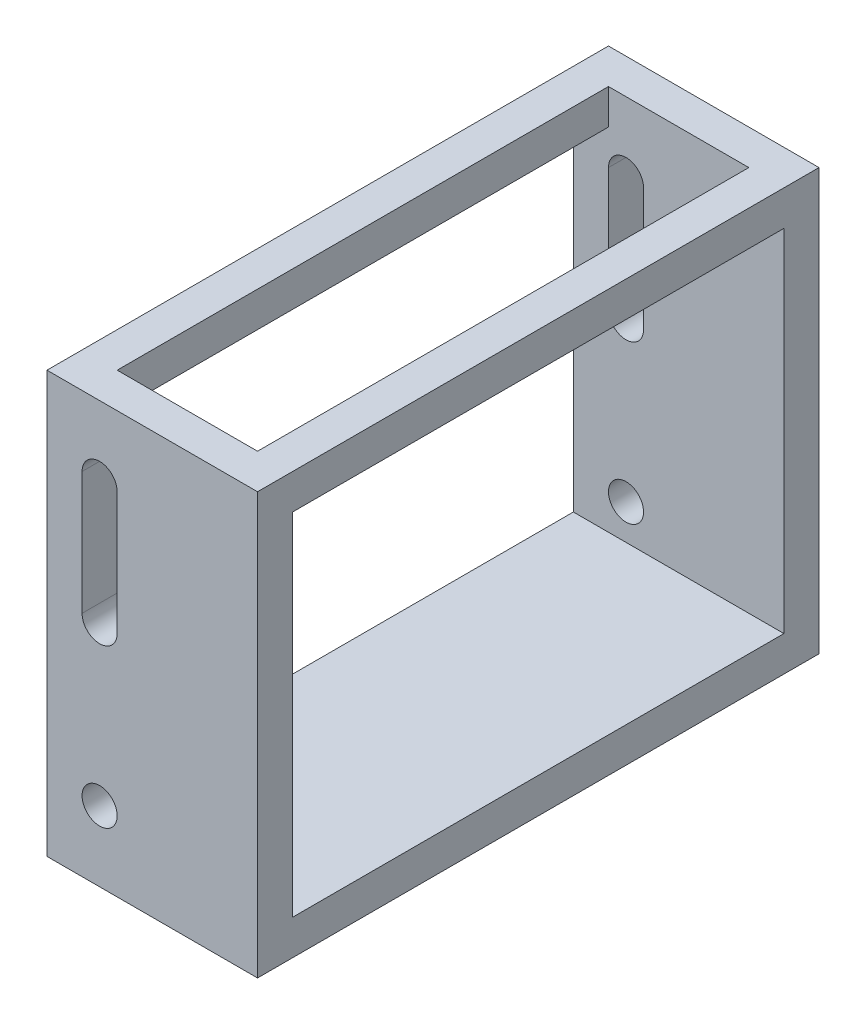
from build123d import *

# Parameters (mm, degrees)
SKETCH1_W           = 76.2
SKETCH1_H           = 203.2
BOSS_EXTRUDE1_DEPTH = 12.7
SKETCH2_W           = 76.2
SKETCH2_H           = 12.7
BOSS_EXTRUDE2_DEPTH = 127
SKETCH3_W           = 76.2
SKETCH3_H           = 203.2
SKETCH3_W_2         = 50.8
SKETCH3_H_2         = 177.8
BOSS_EXTRUDE3_DEPTH = 12.7
SKETCH4_R           = 6.35
CUT_EXTRUDE1_DEPTH  = 266.183785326


with BuildPart() as part:
    # Sketch1 → Boss-Extrude1 (new body)
    with BuildSketch(Plane(origin=(0, 0, 0), x_dir=(1, 0, 0), z_dir=(0, 1, 0))):
        with Locations((38.1, 101.6)):
            Rectangle(SKETCH1_W, SKETCH1_H)
    extrude(amount=BOSS_EXTRUDE1_DEPTH)

    # Sketch2 → Boss-Extrude2 (add)
    with BuildSketch(Plane(origin=(0, 12.7, 0), x_dir=(1, 0, 0), z_dir=(0, 1, 0))):
        with Locations((38.1, 196.85)):
            Rectangle(SKETCH2_W, SKETCH2_H)
        with Locations((38.1, 6.35)):
            Rectangle(SKETCH2_W, SKETCH2_H)
    extrude(amount=BOSS_EXTRUDE2_DEPTH)

    # Sketch3 → Boss-Extrude3 (add)
    with BuildSketch(Plane(origin=(0, 139.7, 0), x_dir=(1, 0, 0), z_dir=(0, 1, 0))):
        with Locations((38.1, 101.6)):
            Rectangle(SKETCH3_W, SKETCH3_H)
        with Locations((38.1, 101.6)):
            Rectangle(SKETCH3_W_2, SKETCH3_H_2, mode=Mode.SUBTRACT)
    extrude(amount=BOSS_EXTRUDE3_DEPTH)

    # Sketch4 → Cut-Extrude1 (cut, through all)
    with BuildSketch(Plane.XY):
        with Locations((19.05, 25.4)):
            Circle(SKETCH4_R)
        with BuildLine():
            Line((12.7, 127), (12.7, 82.55))
            ThreePointArc((12.7, 82.55), (19.05, 76.2), (25.4, 82.55))
            Line((25.4, 82.55), (25.4, 127))
            ThreePointArc((25.4, 127), (19.05, 133.35), (12.7, 127))
        make_face()
    extrude(amount=-CUT_EXTRUDE1_DEPTH, mode=Mode.SUBTRACT)


solid = part.part
